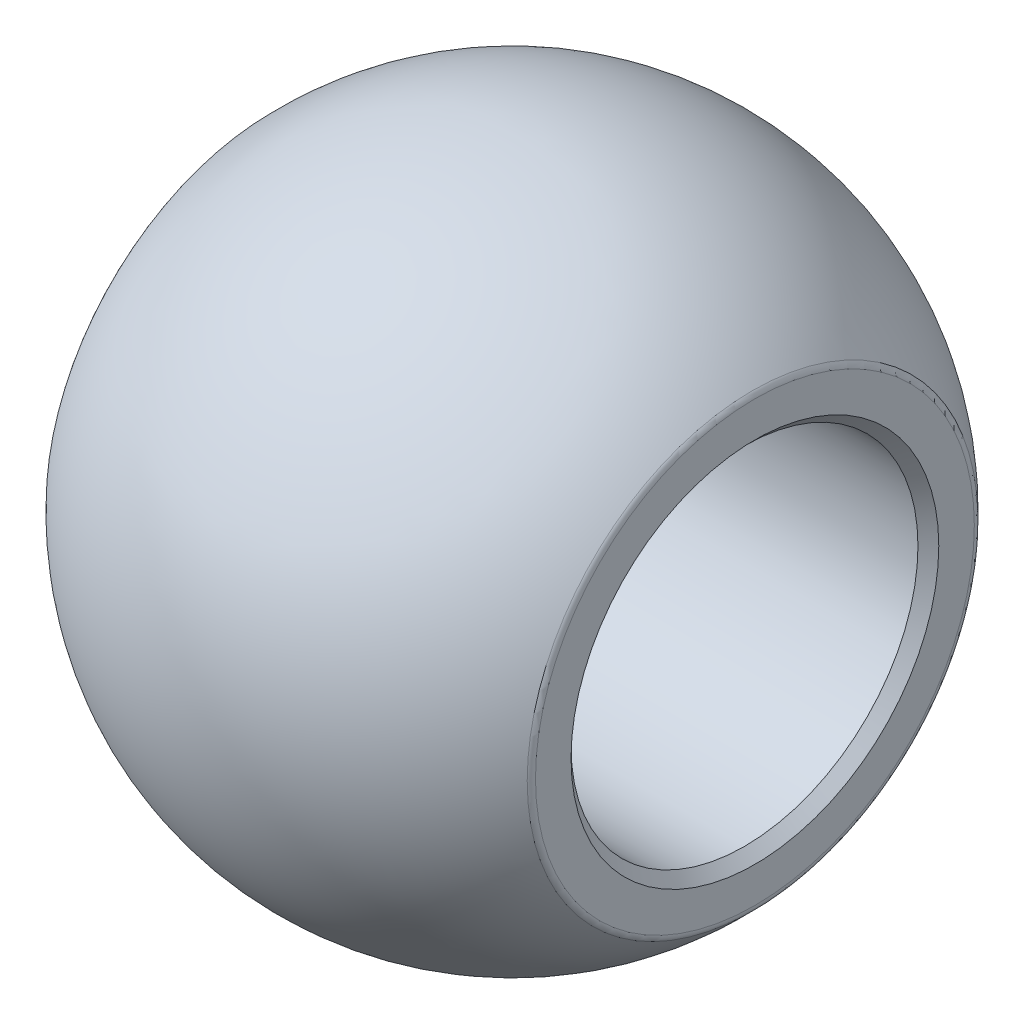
ISO-10303-21;
HEADER;
FILE_DESCRIPTION(('STEP AP214'),'2;1');
FILE_NAME('part.step','',(''),(''),'','','');
FILE_SCHEMA(('AUTOMOTIVE_DESIGN { 1 0 10303 214 1 1 1 1 }'));
ENDSEC;
DATA;
#1=APPLICATION_CONTEXT('core data for automotive mechanical design processes');
#2=APPLICATION_PROTOCOL_DEFINITION('international standard','automotive_design',2000,#1);
#3=PRODUCT_CONTEXT('',#1,'mechanical');
#4=PRODUCT('Part','Part','',(#3));
#5=PRODUCT_RELATED_PRODUCT_CATEGORY('part','',(#4));
#6=PRODUCT_DEFINITION_FORMATION('','',#4);
#7=PRODUCT_DEFINITION_CONTEXT('part definition',#1,'design');
#8=PRODUCT_DEFINITION('design','',#6,#7);
#9=PRODUCT_DEFINITION_SHAPE('','',#8);
#10=(LENGTH_UNIT() NAMED_UNIT(*) SI_UNIT(.MILLI.,.METRE.));
#11=(NAMED_UNIT(*) PLANE_ANGLE_UNIT() SI_UNIT($,.RADIAN.));
#12=(NAMED_UNIT(*) SI_UNIT($,.STERADIAN.) SOLID_ANGLE_UNIT());
#13=UNCERTAINTY_MEASURE_WITH_UNIT(LENGTH_MEASURE(1.E-05),#10,'distance_accuracy_value','');
#14=(GEOMETRIC_REPRESENTATION_CONTEXT(3) GLOBAL_UNCERTAINTY_ASSIGNED_CONTEXT((#13)) GLOBAL_UNIT_ASSIGNED_CONTEXT((#10,
#11,#12)) REPRESENTATION_CONTEXT('',''));
#15=CARTESIAN_POINT('',(0.,0.,0.));
#16=DIRECTION('',(0.,0.,1.));
#17=DIRECTION('',(1.,0.,0.));
#18=AXIS2_PLACEMENT_3D('',#15,#16,#17);
#19=CARTESIAN_POINT('',(-6.75,0.,0.));
#20=DIRECTION('',(-1.,0.,0.));
#21=DIRECTION('',(0.,0.,1.));
#22=AXIS2_PLACEMENT_3D('',#19,#20,#21);
#23=TOROIDAL_SURFACE('',#22,6.32455532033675,0.25);
#24=CARTESIAN_POINT('',(-7.,0.,0.));
#25=DIRECTION('',(-1.,0.,0.));
#26=DIRECTION('',(0.,0.,1.));
#27=AXIS2_PLACEMENT_3D('',#24,#25,#26);
#28=CIRCLE('',#27,6.32455532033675);
#29=CARTESIAN_POINT('',(-7.,0.,6.32455532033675));
#30=VERTEX_POINT('',#29);
#31=EDGE_CURVE('E10',#30,#30,#28,.T.);
#32=ORIENTED_EDGE('',*,*,#31,.F.);
#33=EDGE_LOOP('',(#32));
#34=FACE_BOUND('',#33,.T.);
#35=CARTESIAN_POINT('',(-6.93243243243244,0.,0.));
#36=DIRECTION('',(-1.,0.,0.));
#37=DIRECTION('',(0.,0.,1.));
#38=AXIS2_PLACEMENT_3D('',#35,#36,#37);
#39=CIRCLE('',#38,6.49548924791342);
#40=CARTESIAN_POINT('',(-6.93243243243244,6.49548924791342,0.));
#41=VERTEX_POINT('',#40);
#42=EDGE_CURVE('E58',#41,#41,#39,.T.);
#43=ORIENTED_EDGE('',*,*,#42,.T.);
#44=EDGE_LOOP('',(#43));
#45=FACE_BOUND('',#44,.T.);
#46=ADVANCED_FACE('F30',(#34,#45),#23,.T.);
#47=CARTESIAN_POINT('',(-7.,6.32455532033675,0.));
#48=DIRECTION('',(1.,0.,0.));
#49=DIRECTION('',(0.,0.,-1.));
#50=AXIS2_PLACEMENT_3D('',#47,#48,#49);
#51=PLANE('',#50);
#52=CARTESIAN_POINT('',(-7.,0.,0.));
#53=DIRECTION('',(-1.,0.,0.));
#54=DIRECTION('',(0.,0.,1.));
#55=AXIS2_PLACEMENT_3D('',#52,#53,#54);
#56=CIRCLE('',#55,5.3);
#57=CARTESIAN_POINT('',(-7.,0.,5.3));
#58=VERTEX_POINT('',#57);
#59=EDGE_CURVE('E36',#58,#58,#56,.T.);
#60=ORIENTED_EDGE('',*,*,#59,.F.);
#61=EDGE_LOOP('',(#60));
#62=FACE_BOUND('',#61,.T.);
#63=ORIENTED_EDGE('',*,*,#31,.T.);
#64=EDGE_LOOP('',(#63));
#65=FACE_BOUND('',#64,.T.);
#66=ADVANCED_FACE('F95',(#62,#65),#51,.F.);
#67=CARTESIAN_POINT('',(-7.,0.,0.));
#68=DIRECTION('',(-1.,0.,0.));
#69=DIRECTION('',(0.,0.,1.));
#70=AXIS2_PLACEMENT_3D('',#67,#68,#69);
#71=CONICAL_SURFACE('',#70,5.3,0.785398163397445);
#72=CARTESIAN_POINT('',(-6.7,0.,0.));
#73=DIRECTION('',(-1.,0.,0.));
#74=DIRECTION('',(0.,0.,1.));
#75=AXIS2_PLACEMENT_3D('',#72,#73,#74);
#76=CIRCLE('',#75,5.);
#77=CARTESIAN_POINT('',(-6.7,0.,5.));
#78=VERTEX_POINT('',#77);
#79=EDGE_CURVE('E40',#78,#78,#76,.T.);
#80=ORIENTED_EDGE('',*,*,#79,.F.);
#81=EDGE_LOOP('',(#80));
#82=FACE_BOUND('',#81,.T.);
#83=ORIENTED_EDGE('',*,*,#59,.T.);
#84=EDGE_LOOP('',(#83));
#85=FACE_BOUND('',#84,.T.);
#86=ADVANCED_FACE('F90',(#82,#85),#71,.F.);
#87=CARTESIAN_POINT('',(0.,0.,0.));
#88=DIRECTION('',(-1.,0.,0.));
#89=DIRECTION('',(0.,0.,1.));
#90=AXIS2_PLACEMENT_3D('',#87,#88,#89);
#91=CYLINDRICAL_SURFACE('',#90,5.);
#92=CARTESIAN_POINT('',(6.7,0.,0.));
#93=DIRECTION('',(-1.,0.,0.));
#94=DIRECTION('',(0.,0.,1.));
#95=AXIS2_PLACEMENT_3D('',#92,#93,#94);
#96=CIRCLE('',#95,5.);
#97=CARTESIAN_POINT('',(6.7,0.,5.));
#98=VERTEX_POINT('',#97);
#99=EDGE_CURVE('E44',#98,#98,#96,.T.);
#100=ORIENTED_EDGE('',*,*,#99,.F.);
#101=EDGE_LOOP('',(#100));
#102=FACE_BOUND('',#101,.T.);
#103=ORIENTED_EDGE('',*,*,#79,.T.);
#104=EDGE_LOOP('',(#103));
#105=FACE_BOUND('',#104,.T.);
#106=ADVANCED_FACE('F84',(#102,#105),#91,.F.);
#107=CARTESIAN_POINT('',(6.7,0.,0.));
#108=DIRECTION('',(1.,0.,0.));
#109=DIRECTION('',(0.,0.,-1.));
#110=AXIS2_PLACEMENT_3D('',#107,#108,#109);
#111=CONICAL_SURFACE('',#110,5.,0.785398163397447);
#112=CARTESIAN_POINT('',(7.,0.,0.));
#113=DIRECTION('',(-1.,0.,0.));
#114=DIRECTION('',(0.,0.,1.));
#115=AXIS2_PLACEMENT_3D('',#112,#113,#114);
#116=CIRCLE('',#115,5.3);
#117=CARTESIAN_POINT('',(7.,0.,5.3));
#118=VERTEX_POINT('',#117);
#119=EDGE_CURVE('E49',#118,#118,#116,.T.);
#120=ORIENTED_EDGE('',*,*,#119,.F.);
#121=EDGE_LOOP('',(#120));
#122=FACE_BOUND('',#121,.T.);
#123=ORIENTED_EDGE('',*,*,#99,.T.);
#124=EDGE_LOOP('',(#123));
#125=FACE_BOUND('',#124,.T.);
#126=ADVANCED_FACE('F78',(#122,#125),#111,.F.);
#127=CARTESIAN_POINT('',(7.,6.32455532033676,0.));
#128=DIRECTION('',(-1.,0.,0.));
#129=DIRECTION('',(0.,0.,1.));
#130=AXIS2_PLACEMENT_3D('',#127,#128,#129);
#131=PLANE('',#130);
#132=CARTESIAN_POINT('',(7.,0.,0.));
#133=DIRECTION('',(-1.,0.,0.));
#134=DIRECTION('',(0.,0.,1.));
#135=AXIS2_PLACEMENT_3D('',#132,#133,#134);
#136=CIRCLE('',#135,6.32455532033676);
#137=CARTESIAN_POINT('',(7.,0.,6.32455532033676));
#138=VERTEX_POINT('',#137);
#139=EDGE_CURVE('E52',#138,#138,#136,.T.);
#140=ORIENTED_EDGE('',*,*,#139,.F.);
#141=EDGE_LOOP('',(#140));
#142=FACE_BOUND('',#141,.T.);
#143=ORIENTED_EDGE('',*,*,#119,.T.);
#144=EDGE_LOOP('',(#143));
#145=FACE_BOUND('',#144,.T.);
#146=ADVANCED_FACE('F72',(#142,#145),#131,.F.);
#147=CARTESIAN_POINT('',(6.75,0.,0.));
#148=DIRECTION('',(-1.,0.,0.));
#149=DIRECTION('',(0.,0.,1.));
#150=AXIS2_PLACEMENT_3D('',#147,#148,#149);
#151=TOROIDAL_SURFACE('',#150,6.32455532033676,0.250000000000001);
#152=CARTESIAN_POINT('',(6.93243243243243,0.,0.));
#153=DIRECTION('',(-1.,0.,0.));
#154=DIRECTION('',(0.,0.,1.));
#155=AXIS2_PLACEMENT_3D('',#152,#153,#154);
#156=CIRCLE('',#155,6.49548924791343);
#157=CARTESIAN_POINT('',(6.93243243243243,6.49548924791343,0.));
#158=VERTEX_POINT('',#157);
#159=EDGE_CURVE('E55',#158,#158,#156,.T.);
#160=ORIENTED_EDGE('',*,*,#159,.F.);
#161=EDGE_LOOP('',(#160));
#162=FACE_BOUND('',#161,.T.);
#163=ORIENTED_EDGE('',*,*,#139,.T.);
#164=EDGE_LOOP('',(#163));
#165=FACE_BOUND('',#164,.T.);
#166=ADVANCED_FACE('F66',(#162,#165),#151,.T.);
#167=CARTESIAN_POINT('',(0.,0.,0.));
#168=DIRECTION('',(-1.,0.,0.));
#169=DIRECTION('',(0.,1.,0.));
#170=AXIS2_PLACEMENT_3D('',#167,#168,#169);
#171=SPHERICAL_SURFACE('',#170,9.5);
#172=CARTESIAN_POINT('',(-6.93243243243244,6.49548924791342,0.));
#173=CARTESIAN_POINT('',(-6.82175110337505,6.61362163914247,0.));
#174=CARTESIAN_POINT('',(-6.70804503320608,6.72891946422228,0.));
#175=CARTESIAN_POINT('',(-6.47489232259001,6.95355701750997,0.));
#176=CARTESIAN_POINT('',(-6.3554456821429,7.06289674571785,0.));
#177=CARTESIAN_POINT('',(-6.11112074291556,7.27532914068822,0.));
#178=CARTESIAN_POINT('',(-5.98624244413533,7.3784218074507,0.));
#179=CARTESIAN_POINT('',(-5.73138131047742,7.57809160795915,0.));
#180=CARTESIAN_POINT('',(-5.60139847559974,7.67466874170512,0.));
#181=CARTESIAN_POINT('',(-5.33666765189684,7.86105491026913,0.));
#182=CARTESIAN_POINT('',(-5.20191966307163,7.95086394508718,0.));
#183=CARTESIAN_POINT('',(-4.92801065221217,8.12347933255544,0.));
#184=CARTESIAN_POINT('',(-4.78884963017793,8.20628568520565,0.));
#185=CARTESIAN_POINT('',(-4.50647812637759,8.36467934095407,0.));
#186=CARTESIAN_POINT('',(-4.36326764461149,8.4402666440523,0.));
#187=CARTESIAN_POINT('',(-4.07317139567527,8.58402471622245,0.));
#188=CARTESIAN_POINT('',(-3.92628562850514,8.65219548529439,0.));
#189=CARTESIAN_POINT('',(-3.62922258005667,8.78094237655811,0.));
#190=CARTESIAN_POINT('',(-3.47904529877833,8.84151849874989,0.));
#191=CARTESIAN_POINT('',(-3.1757915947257,8.95491782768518,0.));
#192=CARTESIAN_POINT('',(-3.02271517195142,9.00774103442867,0.));
#193=CARTESIAN_POINT('',(-2.71406313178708,9.10549651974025,0.));
#194=CARTESIAN_POINT('',(-2.55848751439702,9.15042879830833,0.));
#195=CARTESIAN_POINT('',(-2.24524356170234,9.23228503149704,0.));
#196=CARTESIAN_POINT('',(-2.08757522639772,9.26920898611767,0.));
#197=CARTESIAN_POINT('',(-1.77055778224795,9.33495209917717,0.));
#198=CARTESIAN_POINT('',(-1.61120867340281,9.36377125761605,0.));
#199=CARTESIAN_POINT('',(-1.29124601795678,9.41322948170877,0.));
#200=CARTESIAN_POINT('',(-1.1306324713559,9.43386854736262,0.));
#201=CARTESIAN_POINT('',(-0.808560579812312,9.46691266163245,0.));
#202=CARTESIAN_POINT('',(-0.647102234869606,9.47931771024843,0.));
#203=CARTESIAN_POINT('',(-0.3237625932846,9.49586137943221,0.));
#204=CARTESIAN_POINT('',(-0.161881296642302,9.5,0.));
#205=CARTESIAN_POINT('',(0.161881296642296,9.5,0.));
#206=CARTESIAN_POINT('',(0.323762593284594,9.49586137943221,0.));
#207=CARTESIAN_POINT('',(0.647102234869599,9.47931771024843,0.));
#208=CARTESIAN_POINT('',(0.808560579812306,9.46691266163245,0.));
#209=CARTESIAN_POINT('',(1.13063247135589,9.43386854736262,0.));
#210=CARTESIAN_POINT('',(1.29124601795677,9.41322948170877,0.));
#211=CARTESIAN_POINT('',(1.6112086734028,9.36377125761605,0.));
#212=CARTESIAN_POINT('',(1.77055778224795,9.33495209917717,0.));
#213=CARTESIAN_POINT('',(2.08757522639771,9.26920898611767,0.));
#214=CARTESIAN_POINT('',(2.24524356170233,9.23228503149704,0.));
#215=CARTESIAN_POINT('',(2.55848751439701,9.15042879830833,0.));
#216=CARTESIAN_POINT('',(2.71406313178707,9.10549651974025,0.));
#217=CARTESIAN_POINT('',(3.02271517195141,9.00774103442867,0.));
#218=CARTESIAN_POINT('',(3.1757915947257,8.95491782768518,0.));
#219=CARTESIAN_POINT('',(3.47904529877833,8.8415184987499,0.));
#220=CARTESIAN_POINT('',(3.62922258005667,8.78094237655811,0.));
#221=CARTESIAN_POINT('',(3.92628562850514,8.65219548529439,0.));
#222=CARTESIAN_POINT('',(4.07317139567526,8.58402471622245,0.));
#223=CARTESIAN_POINT('',(4.36326764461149,8.4402666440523,0.));
#224=CARTESIAN_POINT('',(4.50647812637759,8.36467934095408,0.));
#225=CARTESIAN_POINT('',(4.78884963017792,8.20628568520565,0.));
#226=CARTESIAN_POINT('',(4.92801065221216,8.12347933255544,0.));
#227=CARTESIAN_POINT('',(5.20191966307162,7.95086394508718,0.));
#228=CARTESIAN_POINT('',(5.33666765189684,7.86105491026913,0.));
#229=CARTESIAN_POINT('',(5.60139847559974,7.67466874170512,0.));
#230=CARTESIAN_POINT('',(5.73138131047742,7.57809160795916,0.));
#231=CARTESIAN_POINT('',(5.98624244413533,7.37842180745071,0.));
#232=CARTESIAN_POINT('',(6.11112074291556,7.27532914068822,0.));
#233=CARTESIAN_POINT('',(6.3554456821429,7.06289674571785,0.));
#234=CARTESIAN_POINT('',(6.47489232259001,6.95355701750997,0.));
#235=CARTESIAN_POINT('',(6.70804503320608,6.72891946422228,0.));
#236=CARTESIAN_POINT('',(6.82175110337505,6.61362163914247,0.));
#237=CARTESIAN_POINT('',(6.93243243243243,6.49548924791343,0.));
#238=B_SPLINE_CURVE_WITH_KNOTS('',3,(#172,#173,#174,#175,#176,#177,#178,#179,#180,#181,#182,
#183,#184,#185,#186,#187,#188,#189,#190,#191,#192,#193,#194,#195,#196,#197,#198,#199,#200,#201,
#202,#203,#204,#205,#206,#207,#208,#209,#210,#211,#212,#213,#214,#215,#216,#217,#218,#219,#220,
#221,#222,#223,#224,#225,#226,#227,#228,#229,#230,#231,#232,#233,#234,#235,#236,#237),
.UNSPECIFIED.,.F.,.F.,(4,2,2,2,2,2,2,2,2,2,2,2,2,2,2,2,2,2,2,2,2,2,2,2,2,2,2,2,2,2,2,2,4),(0.,
0.485591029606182,0.971182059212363,1.45677308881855,1.94236411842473,2.42795514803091,
2.91354617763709,3.39913720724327,3.88472823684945,4.37031926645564,4.85591029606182,
5.341501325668,5.82709235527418,6.31268338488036,6.79827441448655,7.28386544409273,
7.76945647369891,8.25504750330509,8.74063853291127,9.22622956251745,9.71182059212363,
10.1974116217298,10.683002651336,11.1685936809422,11.6541847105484,12.1397757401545,
12.6253667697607,13.1109577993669,13.5965488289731,14.0821398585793,14.5677308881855,
15.0533219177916,15.5389129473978),.UNSPECIFIED.);
#239=EDGE_CURVE('BSEAM63',#41,#158,#238,.T.);
#240=ORIENTED_EDGE('',*,*,#42,.F.);
#241=ORIENTED_EDGE('',*,*,#159,.T.);
#242=ORIENTED_EDGE('',*,*,#239,.T.);
#243=ORIENTED_EDGE('',*,*,#239,.F.);
#244=EDGE_LOOP('',(#240,#242,#241,#243));
#245=FACE_BOUND('',#244,.T.);
#246=ADVANCED_FACE('F63',(#245),#171,.T.);
#247=CLOSED_SHELL('',(#46,#66,#86,#106,#126,#146,#166,#246));
#248=MANIFOLD_SOLID_BREP('B2',#247);
#249=ADVANCED_BREP_SHAPE_REPRESENTATION('',(#18,#248),#14);
#250=SHAPE_DEFINITION_REPRESENTATION(#9,#249);
ENDSEC;
END-ISO-10303-21;
